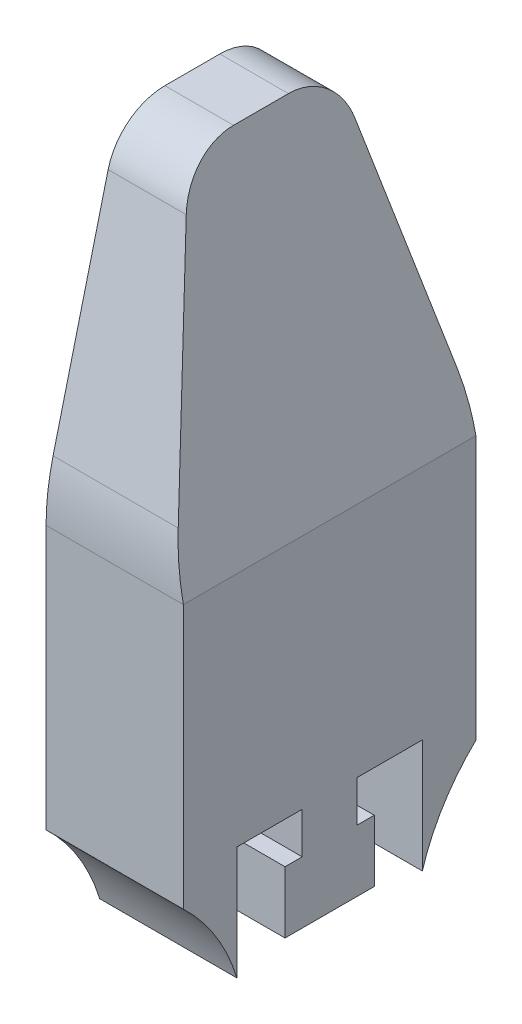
ISO-10303-21;
HEADER;
FILE_DESCRIPTION(('STEP AP214'),'2;1');
FILE_NAME('part.step','',(''),(''),'','','');
FILE_SCHEMA(('AUTOMOTIVE_DESIGN { 1 0 10303 214 1 1 1 1 }'));
ENDSEC;
DATA;
#1=APPLICATION_CONTEXT('core data for automotive mechanical design processes');
#2=APPLICATION_PROTOCOL_DEFINITION('international standard','automotive_design',2000,#1);
#3=PRODUCT_CONTEXT('',#1,'mechanical');
#4=PRODUCT('Part','Part','',(#3));
#5=PRODUCT_RELATED_PRODUCT_CATEGORY('part','',(#4));
#6=PRODUCT_DEFINITION_FORMATION('','',#4);
#7=PRODUCT_DEFINITION_CONTEXT('part definition',#1,'design');
#8=PRODUCT_DEFINITION('design','',#6,#7);
#9=PRODUCT_DEFINITION_SHAPE('','',#8);
#10=(LENGTH_UNIT() NAMED_UNIT(*) SI_UNIT(.MILLI.,.METRE.));
#11=(NAMED_UNIT(*) PLANE_ANGLE_UNIT() SI_UNIT($,.RADIAN.));
#12=(NAMED_UNIT(*) SI_UNIT($,.STERADIAN.) SOLID_ANGLE_UNIT());
#13=UNCERTAINTY_MEASURE_WITH_UNIT(LENGTH_MEASURE(1.E-05),#10,'distance_accuracy_value','');
#14=(GEOMETRIC_REPRESENTATION_CONTEXT(3) GLOBAL_UNCERTAINTY_ASSIGNED_CONTEXT((#13)) GLOBAL_UNIT_ASSIGNED_CONTEXT((#10,
#11,#12)) REPRESENTATION_CONTEXT('',''));
#15=CARTESIAN_POINT('',(0.,0.,0.));
#16=DIRECTION('',(0.,0.,1.));
#17=DIRECTION('',(1.,0.,0.));
#18=AXIS2_PLACEMENT_3D('',#15,#16,#17);
#19=CARTESIAN_POINT('',(20.,-55.2887120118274,41.410883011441));
#20=DIRECTION('',(-1.,0.,0.));
#21=DIRECTION('',(0.,0.,1.));
#22=AXIS2_PLACEMENT_3D('',#19,#20,#21);
#23=CYLINDRICAL_SURFACE('',#22,29.2058551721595);
#24=CARTESIAN_POINT('',(0.,-55.2887120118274,41.410883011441));
#25=DIRECTION('',(-1.,0.,0.));
#26=DIRECTION('',(0.,0.,1.));
#27=AXIS2_PLACEMENT_3D('',#24,#25,#26);
#28=CIRCLE('',#27,29.2058551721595);
#29=CARTESIAN_POINT('',(0.,-34.0988821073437,21.3118013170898));
#30=VERTEX_POINT('',#29);
#31=CARTESIAN_POINT('',(0.,-46.6884453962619,13.5));
#32=VERTEX_POINT('',#31);
#33=EDGE_CURVE('E208',#30,#32,#28,.T.);
#34=ORIENTED_EDGE('',*,*,#33,.T.);
#35=DIRECTION('',(-1.,0.,0.));
#36=VECTOR('',#35,1.);
#37=CARTESIAN_POINT('',(20.,-46.6884453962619,13.5));
#38=LINE('',#37,#36);
#39=CARTESIAN_POINT('',(20.,-46.6884453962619,13.5));
#40=VERTEX_POINT('',#39);
#41=EDGE_CURVE('E11',#40,#32,#38,.T.);
#42=ORIENTED_EDGE('',*,*,#41,.F.);
#43=CARTESIAN_POINT('',(20.,-55.2887120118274,41.410883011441));
#44=DIRECTION('',(-1.,0.,0.));
#45=DIRECTION('',(0.,0.,1.));
#46=AXIS2_PLACEMENT_3D('',#43,#44,#45);
#47=CIRCLE('',#46,29.2058551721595);
#48=CARTESIAN_POINT('',(20.,-34.0988821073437,21.3118013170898));
#49=VERTEX_POINT('',#48);
#50=EDGE_CURVE('E267',#49,#40,#47,.T.);
#51=ORIENTED_EDGE('',*,*,#50,.F.);
#52=DIRECTION('',(-1.,0.,0.));
#53=VECTOR('',#52,1.);
#54=CARTESIAN_POINT('',(20.,-34.0988821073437,21.3118013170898));
#55=LINE('',#54,#53);
#56=EDGE_CURVE('E55',#49,#30,#55,.T.);
#57=ORIENTED_EDGE('',*,*,#56,.T.);
#58=EDGE_LOOP('',(#34,#42,#51,#57));
#59=FACE_BOUND('',#58,.T.);
#60=ADVANCED_FACE('F39',(#59),#23,.F.);
#61=CARTESIAN_POINT('',(20.,-46.6884453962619,13.5));
#62=DIRECTION('',(0.,0.,1.));
#63=DIRECTION('',(0.,-1.,0.));
#64=AXIS2_PLACEMENT_3D('',#61,#62,#63);
#65=PLANE('',#64);
#66=DIRECTION('',(0.,1.,0.));
#67=VECTOR('',#66,1.);
#68=CARTESIAN_POINT('',(0.,-46.6884453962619,13.5));
#69=LINE('',#68,#67);
#70=CARTESIAN_POINT('',(0.,-30.1483231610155,13.5));
#71=VERTEX_POINT('',#70);
#72=EDGE_CURVE('E210',#32,#71,#69,.T.);
#73=ORIENTED_EDGE('',*,*,#72,.T.);
#74=DIRECTION('',(-1.,0.,0.));
#75=VECTOR('',#74,1.);
#76=CARTESIAN_POINT('',(20.,-30.1483231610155,13.5));
#77=LINE('',#76,#75);
#78=CARTESIAN_POINT('',(20.,-30.1483231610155,13.5));
#79=VERTEX_POINT('',#78);
#80=EDGE_CURVE('E47',#79,#71,#77,.T.);
#81=ORIENTED_EDGE('',*,*,#80,.F.);
#82=DIRECTION('',(0.,1.,0.));
#83=VECTOR('',#82,1.);
#84=CARTESIAN_POINT('',(20.,-46.6884453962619,13.5));
#85=LINE('',#84,#83);
#86=EDGE_CURVE('E137',#40,#79,#85,.T.);
#87=ORIENTED_EDGE('',*,*,#86,.F.);
#88=ORIENTED_EDGE('',*,*,#41,.T.);
#89=EDGE_LOOP('',(#73,#81,#87,#88));
#90=FACE_BOUND('',#89,.T.);
#91=ADVANCED_FACE('F371',(#90),#65,.F.);
#92=CARTESIAN_POINT('',(20.,-30.1483231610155,13.5));
#93=DIRECTION('',(0.,1.,0.));
#94=DIRECTION('',(0.,0.,1.));
#95=AXIS2_PLACEMENT_3D('',#92,#93,#94);
#96=PLANE('',#95);
#97=DIRECTION('',(0.,0.,-1.));
#98=VECTOR('',#97,1.);
#99=CARTESIAN_POINT('',(0.,-30.1483231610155,13.5));
#100=LINE('',#99,#98);
#101=CARTESIAN_POINT('',(0.,-30.1483231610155,4.));
#102=VERTEX_POINT('',#101);
#103=EDGE_CURVE('E213',#71,#102,#100,.T.);
#104=ORIENTED_EDGE('',*,*,#103,.T.);
#105=DIRECTION('',(-1.,0.,0.));
#106=VECTOR('',#105,1.);
#107=CARTESIAN_POINT('',(20.,-30.1483231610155,4.));
#108=LINE('',#107,#106);
#109=CARTESIAN_POINT('',(20.,-30.1483231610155,4.));
#110=VERTEX_POINT('',#109);
#111=EDGE_CURVE('E302',#110,#102,#108,.T.);
#112=ORIENTED_EDGE('',*,*,#111,.F.);
#113=DIRECTION('',(0.,0.,-1.));
#114=VECTOR('',#113,1.);
#115=CARTESIAN_POINT('',(20.,-30.1483231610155,13.5));
#116=LINE('',#115,#114);
#117=EDGE_CURVE('E309',#79,#110,#116,.T.);
#118=ORIENTED_EDGE('',*,*,#117,.F.);
#119=ORIENTED_EDGE('',*,*,#80,.T.);
#120=EDGE_LOOP('',(#104,#112,#118,#119));
#121=FACE_BOUND('',#120,.T.);
#122=ADVANCED_FACE('F307',(#121),#96,.F.);
#123=CARTESIAN_POINT('',(20.,-36.1483231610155,4.));
#124=DIRECTION('',(0.,0.,1.));
#125=DIRECTION('',(0.,-1.,0.));
#126=AXIS2_PLACEMENT_3D('',#123,#124,#125);
#127=PLANE('',#126);
#128=DIRECTION('',(0.,1.,0.));
#129=VECTOR('',#128,1.);
#130=CARTESIAN_POINT('',(0.,-36.1483231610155,4.));
#131=LINE('',#130,#129);
#132=CARTESIAN_POINT('',(0.,-36.1483231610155,4.));
#133=VERTEX_POINT('',#132);
#134=EDGE_CURVE('E216',#133,#102,#131,.T.);
#135=ORIENTED_EDGE('',*,*,#134,.F.);
#136=DIRECTION('',(-1.,0.,0.));
#137=VECTOR('',#136,1.);
#138=CARTESIAN_POINT('',(20.,-36.1483231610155,4.));
#139=LINE('',#138,#137);
#140=CARTESIAN_POINT('',(20.,-36.1483231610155,4.));
#141=VERTEX_POINT('',#140);
#142=EDGE_CURVE('E300',#141,#133,#139,.T.);
#143=ORIENTED_EDGE('',*,*,#142,.F.);
#144=DIRECTION('',(0.,1.,0.));
#145=VECTOR('',#144,1.);
#146=CARTESIAN_POINT('',(20.,-36.1483231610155,4.));
#147=LINE('',#146,#145);
#148=EDGE_CURVE('E318',#141,#110,#147,.T.);
#149=ORIENTED_EDGE('',*,*,#148,.T.);
#150=ORIENTED_EDGE('',*,*,#111,.T.);
#151=EDGE_LOOP('',(#135,#143,#149,#150));
#152=FACE_BOUND('',#151,.T.);
#153=ADVANCED_FACE('F315',(#152),#127,.T.);
#154=CARTESIAN_POINT('',(20.,-36.1483231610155,6.5));
#155=DIRECTION('',(0.,1.,0.));
#156=DIRECTION('',(0.,0.,1.));
#157=AXIS2_PLACEMENT_3D('',#154,#155,#156);
#158=PLANE('',#157);
#159=DIRECTION('',(0.,0.,-1.));
#160=VECTOR('',#159,1.);
#161=CARTESIAN_POINT('',(0.,-36.1483231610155,6.5));
#162=LINE('',#161,#160);
#163=CARTESIAN_POINT('',(0.,-36.1483231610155,6.5));
#164=VERTEX_POINT('',#163);
#165=EDGE_CURVE('E219',#164,#133,#162,.T.);
#166=ORIENTED_EDGE('',*,*,#165,.F.);
#167=DIRECTION('',(-1.,0.,0.));
#168=VECTOR('',#167,1.);
#169=CARTESIAN_POINT('',(20.,-36.1483231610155,6.5));
#170=LINE('',#169,#168);
#171=CARTESIAN_POINT('',(20.,-36.1483231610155,6.5));
#172=VERTEX_POINT('',#171);
#173=EDGE_CURVE('E298',#172,#164,#170,.T.);
#174=ORIENTED_EDGE('',*,*,#173,.F.);
#175=DIRECTION('',(0.,0.,-1.));
#176=VECTOR('',#175,1.);
#177=CARTESIAN_POINT('',(20.,-36.1483231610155,6.5));
#178=LINE('',#177,#176);
#179=EDGE_CURVE('E321',#172,#141,#178,.T.);
#180=ORIENTED_EDGE('',*,*,#179,.T.);
#181=ORIENTED_EDGE('',*,*,#142,.T.);
#182=EDGE_LOOP('',(#166,#174,#180,#181));
#183=FACE_BOUND('',#182,.T.);
#184=ADVANCED_FACE('F381',(#183),#158,.T.);
#185=CARTESIAN_POINT('',(20.,-45.1483231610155,6.5));
#186=DIRECTION('',(0.,0.,1.));
#187=DIRECTION('',(1.,0.,0.));
#188=AXIS2_PLACEMENT_3D('',#185,#186,#187);
#189=PLANE('',#188);
#190=DIRECTION('',(0.,1.,0.));
#191=VECTOR('',#190,1.);
#192=CARTESIAN_POINT('',(0.,-45.1483231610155,6.5));
#193=LINE('',#192,#191);
#194=CARTESIAN_POINT('',(0.,-45.1483231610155,6.5));
#195=VERTEX_POINT('',#194);
#196=EDGE_CURVE('E222',#195,#164,#193,.T.);
#197=ORIENTED_EDGE('',*,*,#196,.F.);
#198=DIRECTION('',(-1.,0.,0.));
#199=VECTOR('',#198,1.);
#200=CARTESIAN_POINT('',(20.,-45.1483231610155,6.5));
#201=LINE('',#200,#199);
#202=CARTESIAN_POINT('',(20.,-45.1483231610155,6.5));
#203=VERTEX_POINT('',#202);
#204=EDGE_CURVE('E296',#203,#195,#201,.T.);
#205=ORIENTED_EDGE('',*,*,#204,.F.);
#206=DIRECTION('',(0.,1.,0.));
#207=VECTOR('',#206,1.);
#208=CARTESIAN_POINT('',(20.,-45.1483231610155,6.5));
#209=LINE('',#208,#207);
#210=EDGE_CURVE('E323',#203,#172,#209,.T.);
#211=ORIENTED_EDGE('',*,*,#210,.T.);
#212=ORIENTED_EDGE('',*,*,#173,.T.);
#213=EDGE_LOOP('',(#197,#205,#211,#212));
#214=FACE_BOUND('',#213,.T.);
#215=ADVANCED_FACE('F384',(#214),#189,.T.);
#216=CARTESIAN_POINT('',(20.,-45.1483231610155,6.5));
#217=DIRECTION('',(0.,1.,0.));
#218=DIRECTION('',(0.,0.,1.));
#219=AXIS2_PLACEMENT_3D('',#216,#217,#218);
#220=PLANE('',#219);
#221=DIRECTION('',(0.,0.,-1.));
#222=VECTOR('',#221,1.);
#223=CARTESIAN_POINT('',(0.,-45.1483231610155,6.5));
#224=LINE('',#223,#222);
#225=CARTESIAN_POINT('',(0.,-45.1483231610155,-6.5));
#226=VERTEX_POINT('',#225);
#227=EDGE_CURVE('E225',#195,#226,#224,.T.);
#228=ORIENTED_EDGE('',*,*,#227,.T.);
#229=DIRECTION('',(-1.,0.,0.));
#230=VECTOR('',#229,1.);
#231=CARTESIAN_POINT('',(20.,-45.1483231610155,-6.5));
#232=LINE('',#231,#230);
#233=CARTESIAN_POINT('',(20.,-45.1483231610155,-6.5));
#234=VERTEX_POINT('',#233);
#235=EDGE_CURVE('E293',#234,#226,#232,.T.);
#236=ORIENTED_EDGE('',*,*,#235,.F.);
#237=DIRECTION('',(0.,0.,-1.));
#238=VECTOR('',#237,1.);
#239=CARTESIAN_POINT('',(20.,-45.1483231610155,6.5));
#240=LINE('',#239,#238);
#241=EDGE_CURVE('E330',#203,#234,#240,.T.);
#242=ORIENTED_EDGE('',*,*,#241,.F.);
#243=ORIENTED_EDGE('',*,*,#204,.T.);
#244=EDGE_LOOP('',(#228,#236,#242,#243));
#245=FACE_BOUND('',#244,.T.);
#246=ADVANCED_FACE('F388',(#245),#220,.F.);
#247=CARTESIAN_POINT('',(20.,-45.1483231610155,-6.5));
#248=DIRECTION('',(0.,0.,1.));
#249=DIRECTION('',(0.,-1.,0.));
#250=AXIS2_PLACEMENT_3D('',#247,#248,#249);
#251=PLANE('',#250);
#252=DIRECTION('',(0.,1.,0.));
#253=VECTOR('',#252,1.);
#254=CARTESIAN_POINT('',(0.,-45.1483231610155,-6.5));
#255=LINE('',#254,#253);
#256=CARTESIAN_POINT('',(0.,-36.1483231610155,-6.5));
#257=VERTEX_POINT('',#256);
#258=EDGE_CURVE('E227',#226,#257,#255,.T.);
#259=ORIENTED_EDGE('',*,*,#258,.T.);
#260=DIRECTION('',(-1.,0.,0.));
#261=VECTOR('',#260,1.);
#262=CARTESIAN_POINT('',(20.,-36.1483231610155,-6.5));
#263=LINE('',#262,#261);
#264=CARTESIAN_POINT('',(20.,-36.1483231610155,-6.5));
#265=VERTEX_POINT('',#264);
#266=EDGE_CURVE('E291',#265,#257,#263,.T.);
#267=ORIENTED_EDGE('',*,*,#266,.F.);
#268=DIRECTION('',(0.,1.,0.));
#269=VECTOR('',#268,1.);
#270=CARTESIAN_POINT('',(20.,-45.1483231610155,-6.5));
#271=LINE('',#270,#269);
#272=EDGE_CURVE('E332',#234,#265,#271,.T.);
#273=ORIENTED_EDGE('',*,*,#272,.F.);
#274=ORIENTED_EDGE('',*,*,#235,.T.);
#275=EDGE_LOOP('',(#259,#267,#273,#274));
#276=FACE_BOUND('',#275,.T.);
#277=ADVANCED_FACE('F392',(#276),#251,.F.);
#278=CARTESIAN_POINT('',(20.,-36.1483231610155,-4.));
#279=DIRECTION('',(0.,1.,0.));
#280=DIRECTION('',(0.,0.,1.));
#281=AXIS2_PLACEMENT_3D('',#278,#279,#280);
#282=PLANE('',#281);
#283=DIRECTION('',(0.,0.,-1.));
#284=VECTOR('',#283,1.);
#285=CARTESIAN_POINT('',(0.,-36.1483231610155,-4.));
#286=LINE('',#285,#284);
#287=CARTESIAN_POINT('',(0.,-36.1483231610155,-4.));
#288=VERTEX_POINT('',#287);
#289=EDGE_CURVE('E230',#288,#257,#286,.T.);
#290=ORIENTED_EDGE('',*,*,#289,.F.);
#291=DIRECTION('',(-1.,0.,0.));
#292=VECTOR('',#291,1.);
#293=CARTESIAN_POINT('',(20.,-36.1483231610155,-4.));
#294=LINE('',#293,#292);
#295=CARTESIAN_POINT('',(20.,-36.1483231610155,-4.));
#296=VERTEX_POINT('',#295);
#297=EDGE_CURVE('E289',#296,#288,#294,.T.);
#298=ORIENTED_EDGE('',*,*,#297,.F.);
#299=DIRECTION('',(0.,0.,-1.));
#300=VECTOR('',#299,1.);
#301=CARTESIAN_POINT('',(20.,-36.1483231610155,-4.));
#302=LINE('',#301,#300);
#303=EDGE_CURVE('E334',#296,#265,#302,.T.);
#304=ORIENTED_EDGE('',*,*,#303,.T.);
#305=ORIENTED_EDGE('',*,*,#266,.T.);
#306=EDGE_LOOP('',(#290,#298,#304,#305));
#307=FACE_BOUND('',#306,.T.);
#308=ADVANCED_FACE('F396',(#307),#282,.T.);
#309=CARTESIAN_POINT('',(20.,-36.1483231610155,-4.));
#310=DIRECTION('',(0.,0.,1.));
#311=DIRECTION('',(1.,0.,0.));
#312=AXIS2_PLACEMENT_3D('',#309,#310,#311);
#313=PLANE('',#312);
#314=DIRECTION('',(0.,1.,0.));
#315=VECTOR('',#314,1.);
#316=CARTESIAN_POINT('',(0.,-36.1483231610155,-4.));
#317=LINE('',#316,#315);
#318=CARTESIAN_POINT('',(0.,-30.1483231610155,-4.));
#319=VERTEX_POINT('',#318);
#320=EDGE_CURVE('E233',#288,#319,#317,.T.);
#321=ORIENTED_EDGE('',*,*,#320,.T.);
#322=DIRECTION('',(-1.,0.,0.));
#323=VECTOR('',#322,1.);
#324=CARTESIAN_POINT('',(20.,-30.1483231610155,-4.));
#325=LINE('',#324,#323);
#326=CARTESIAN_POINT('',(20.,-30.1483231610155,-4.));
#327=VERTEX_POINT('',#326);
#328=EDGE_CURVE('E286',#327,#319,#325,.T.);
#329=ORIENTED_EDGE('',*,*,#328,.F.);
#330=DIRECTION('',(0.,1.,0.));
#331=VECTOR('',#330,1.);
#332=CARTESIAN_POINT('',(20.,-36.1483231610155,-4.));
#333=LINE('',#332,#331);
#334=EDGE_CURVE('E337',#296,#327,#333,.T.);
#335=ORIENTED_EDGE('',*,*,#334,.F.);
#336=ORIENTED_EDGE('',*,*,#297,.T.);
#337=EDGE_LOOP('',(#321,#329,#335,#336));
#338=FACE_BOUND('',#337,.T.);
#339=ADVANCED_FACE('F400',(#338),#313,.F.);
#340=CARTESIAN_POINT('',(20.,-30.1483231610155,-4.));
#341=DIRECTION('',(0.,1.,0.));
#342=DIRECTION('',(0.,0.,1.));
#343=AXIS2_PLACEMENT_3D('',#340,#341,#342);
#344=PLANE('',#343);
#345=DIRECTION('',(0.,0.,-1.));
#346=VECTOR('',#345,1.);
#347=CARTESIAN_POINT('',(0.,-30.1483231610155,-4.));
#348=LINE('',#347,#346);
#349=CARTESIAN_POINT('',(0.,-30.1483231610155,-13.5));
#350=VERTEX_POINT('',#349);
#351=EDGE_CURVE('E235',#319,#350,#348,.T.);
#352=ORIENTED_EDGE('',*,*,#351,.T.);
#353=DIRECTION('',(-1.,0.,0.));
#354=VECTOR('',#353,1.);
#355=CARTESIAN_POINT('',(20.,-30.1483231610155,-13.5));
#356=LINE('',#355,#354);
#357=CARTESIAN_POINT('',(20.,-30.1483231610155,-13.5));
#358=VERTEX_POINT('',#357);
#359=EDGE_CURVE('E284',#358,#350,#356,.T.);
#360=ORIENTED_EDGE('',*,*,#359,.F.);
#361=DIRECTION('',(0.,0.,-1.));
#362=VECTOR('',#361,1.);
#363=CARTESIAN_POINT('',(20.,-30.1483231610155,-4.));
#364=LINE('',#363,#362);
#365=EDGE_CURVE('E203',#327,#358,#364,.T.);
#366=ORIENTED_EDGE('',*,*,#365,.F.);
#367=ORIENTED_EDGE('',*,*,#328,.T.);
#368=EDGE_LOOP('',(#352,#360,#366,#367));
#369=FACE_BOUND('',#368,.T.);
#370=ADVANCED_FACE('F344',(#369),#344,.F.);
#371=CARTESIAN_POINT('',(20.,-46.6884453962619,-13.5));
#372=DIRECTION('',(0.,0.,1.));
#373=DIRECTION('',(0.,-1.,0.));
#374=AXIS2_PLACEMENT_3D('',#371,#372,#373);
#375=PLANE('',#374);
#376=DIRECTION('',(0.,1.,0.));
#377=VECTOR('',#376,1.);
#378=CARTESIAN_POINT('',(0.,-46.6884453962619,-13.5));
#379=LINE('',#378,#377);
#380=CARTESIAN_POINT('',(0.,-46.6884453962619,-13.5));
#381=VERTEX_POINT('',#380);
#382=EDGE_CURVE('E238',#381,#350,#379,.T.);
#383=ORIENTED_EDGE('',*,*,#382,.F.);
#384=DIRECTION('',(-1.,0.,0.));
#385=VECTOR('',#384,1.);
#386=CARTESIAN_POINT('',(20.,-46.6884453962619,-13.5));
#387=LINE('',#386,#385);
#388=CARTESIAN_POINT('',(20.,-46.6884453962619,-13.5));
#389=VERTEX_POINT('',#388);
#390=EDGE_CURVE('E186',#389,#381,#387,.T.);
#391=ORIENTED_EDGE('',*,*,#390,.F.);
#392=DIRECTION('',(0.,1.,0.));
#393=VECTOR('',#392,1.);
#394=CARTESIAN_POINT('',(20.,-46.6884453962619,-13.5));
#395=LINE('',#394,#393);
#396=EDGE_CURVE('E201',#389,#358,#395,.T.);
#397=ORIENTED_EDGE('',*,*,#396,.T.);
#398=ORIENTED_EDGE('',*,*,#359,.T.);
#399=EDGE_LOOP('',(#383,#391,#397,#398));
#400=FACE_BOUND('',#399,.T.);
#401=ADVANCED_FACE('F348',(#400),#375,.T.);
#402=CARTESIAN_POINT('',(20.,-55.2887120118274,-41.410883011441));
#403=DIRECTION('',(-1.,0.,0.));
#404=DIRECTION('',(0.,0.,1.));
#405=AXIS2_PLACEMENT_3D('',#402,#403,#404);
#406=CYLINDRICAL_SURFACE('',#405,29.2058551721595);
#407=CARTESIAN_POINT('',(0.,-55.2887120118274,-41.410883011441));
#408=DIRECTION('',(1.,0.,0.));
#409=DIRECTION('',(0.,0.,-1.));
#410=AXIS2_PLACEMENT_3D('',#407,#408,#409);
#411=CIRCLE('',#410,29.2058551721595);
#412=CARTESIAN_POINT('',(0.,-34.0988821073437,-21.3118013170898));
#413=VERTEX_POINT('',#412);
#414=EDGE_CURVE('E182',#413,#381,#411,.T.);
#415=ORIENTED_EDGE('',*,*,#414,.F.);
#416=DIRECTION('',(-1.,0.,0.));
#417=VECTOR('',#416,1.);
#418=CARTESIAN_POINT('',(20.,-34.0988821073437,-21.3118013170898));
#419=LINE('',#418,#417);
#420=CARTESIAN_POINT('',(20.,-34.0988821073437,-21.3118013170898));
#421=VERTEX_POINT('',#420);
#422=EDGE_CURVE('E176',#421,#413,#419,.T.);
#423=ORIENTED_EDGE('',*,*,#422,.F.);
#424=CARTESIAN_POINT('',(20.,-55.2887120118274,-41.410883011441));
#425=DIRECTION('',(1.,0.,0.));
#426=DIRECTION('',(0.,0.,-1.));
#427=AXIS2_PLACEMENT_3D('',#424,#425,#426);
#428=CIRCLE('',#427,29.2058551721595);
#429=EDGE_CURVE('E180',#421,#389,#428,.T.);
#430=ORIENTED_EDGE('',*,*,#429,.T.);
#431=ORIENTED_EDGE('',*,*,#390,.T.);
#432=EDGE_LOOP('',(#415,#423,#430,#431));
#433=FACE_BOUND('',#432,.T.);
#434=ADVANCED_FACE('F178',(#433),#406,.F.);
#435=CARTESIAN_POINT('',(20.,-34.0988821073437,-21.3118013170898));
#436=DIRECTION('',(0.,0.,1.));
#437=DIRECTION('',(1.,0.,0.));
#438=AXIS2_PLACEMENT_3D('',#435,#436,#437);
#439=PLANE('',#438);
#440=DIRECTION('',(0.,1.,0.));
#441=VECTOR('',#440,1.);
#442=CARTESIAN_POINT('',(0.,-34.0988821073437,-21.3118013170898));
#443=LINE('',#442,#441);
#444=CARTESIAN_POINT('',(0.,4.32695631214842,-21.3118013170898));
#445=VERTEX_POINT('',#444);
#446=EDGE_CURVE('E242',#413,#445,#443,.T.);
#447=ORIENTED_EDGE('',*,*,#446,.T.);
#448=DIRECTION('',(-1.,0.,0.));
#449=VECTOR('',#448,1.);
#450=CARTESIAN_POINT('',(20.,4.32695631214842,-21.3118013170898));
#451=LINE('',#450,#449);
#452=CARTESIAN_POINT('',(20.,4.3269563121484,-21.3118013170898));
#453=VERTEX_POINT('',#452);
#454=EDGE_CURVE('E187',#453,#445,#451,.T.);
#455=ORIENTED_EDGE('',*,*,#454,.F.);
#456=DIRECTION('',(0.,1.,0.));
#457=VECTOR('',#456,1.);
#458=CARTESIAN_POINT('',(20.,-34.0988821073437,-21.3118013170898));
#459=LINE('',#458,#457);
#460=EDGE_CURVE('E191',#421,#453,#459,.T.);
#461=ORIENTED_EDGE('',*,*,#460,.F.);
#462=ORIENTED_EDGE('',*,*,#422,.T.);
#463=EDGE_LOOP('',(#447,#455,#461,#462));
#464=FACE_BOUND('',#463,.T.);
#465=ADVANCED_FACE('F192',(#464),#439,.F.);
#466=CARTESIAN_POINT('',(20.,4.32695631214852,12.7870807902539));
#467=DIRECTION('',(-1.,0.,0.));
#468=DIRECTION('',(0.,0.,1.));
#469=AXIS2_PLACEMENT_3D('',#466,#467,#468);
#470=CYLINDRICAL_SURFACE('',#469,34.0988821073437);
#471=CARTESIAN_POINT('',(20.,4.32695631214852,12.7870807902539));
#472=DIRECTION('',(-0.977944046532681,-0.208867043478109,0.));
#473=DIRECTION('',(-0.208867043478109,0.977944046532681,0.));
#474=AXIS2_PLACEMENT_3D('',#471,#472,#473);
#475=ELLIPSE('',#474,34.8679274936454,34.0988821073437);
#476=CARTESIAN_POINT('',(18.2336710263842,12.5971499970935,-20.2936939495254));
#477=VERTEX_POINT('',#476);
#478=EDGE_CURVE('E211',#453,#477,#475,.F.);
#479=ORIENTED_EDGE('',*,*,#478,.F.);
#480=ORIENTED_EDGE('',*,*,#454,.T.);
#481=CARTESIAN_POINT('',(0.,4.32695631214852,12.7870807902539));
#482=DIRECTION('',(-1.,0.,0.));
#483=DIRECTION('',(0.,0.,1.));
#484=AXIS2_PLACEMENT_3D('',#481,#482,#483);
#485=CIRCLE('',#484,34.0988821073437);
#486=CARTESIAN_POINT('',(0.,12.5971499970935,-20.2936939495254));
#487=VERTEX_POINT('',#486);
#488=EDGE_CURVE('E244',#487,#445,#485,.T.);
#489=ORIENTED_EDGE('',*,*,#488,.F.);
#490=DIRECTION('',(-1.,0.,0.));
#491=VECTOR('',#490,1.);
#492=CARTESIAN_POINT('',(20.,12.5971499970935,-20.2936939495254));
#493=LINE('',#492,#491);
#494=EDGE_CURVE('E280',#477,#487,#493,.T.);
#495=ORIENTED_EDGE('',*,*,#494,.F.);
#496=EDGE_LOOP('',(#479,#480,#489,#495));
#497=FACE_BOUND('',#496,.T.);
#498=ADVANCED_FACE('F355',(#497),#470,.T.);
#499=CARTESIAN_POINT('',(20.,12.5971499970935,-20.2936939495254));
#500=DIRECTION('',(0.,-0.242535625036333,0.970142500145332));
#501=DIRECTION('',(0.,-0.970142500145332,-0.242535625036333));
#502=AXIS2_PLACEMENT_3D('',#499,#500,#501);
#503=PLANE('',#502);
#504=DIRECTION('',(-1.,0.,0.));
#505=VECTOR('',#504,1.);
#506=CARTESIAN_POINT('',(20.,44.6911510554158,-12.2701936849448));
#507=LINE('',#506,#505);
#508=CARTESIAN_POINT('',(11.3791079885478,44.6911510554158,-12.2701936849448));
#509=VERTEX_POINT('',#508);
#510=CARTESIAN_POINT('',(0.,44.6911510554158,-12.2701936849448));
#511=VERTEX_POINT('',#510);
#512=EDGE_CURVE('E278',#509,#511,#507,.T.);
#513=ORIENTED_EDGE('',*,*,#512,.F.);
#514=DIRECTION('',(0.202891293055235,-0.949964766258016,-0.237491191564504));
#515=VECTOR('',#514,1.);
#516=CARTESIAN_POINT('',(18.3063817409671,12.2567084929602,-20.3788043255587));
#517=LINE('',#516,#515);
#518=EDGE_CURVE('E363',#509,#477,#517,.T.);
#519=ORIENTED_EDGE('',*,*,#518,.T.);
#520=ORIENTED_EDGE('',*,*,#494,.T.);
#521=DIRECTION('',(0.,0.970142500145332,0.242535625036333));
#522=VECTOR('',#521,1.);
#523=CARTESIAN_POINT('',(0.,12.5971499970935,-20.2936939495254));
#524=LINE('',#523,#522);
#525=EDGE_CURVE('E247',#487,#511,#524,.T.);
#526=ORIENTED_EDGE('',*,*,#525,.T.);
#527=EDGE_LOOP('',(#513,#519,#520,#526));
#528=FACE_BOUND('',#527,.T.);
#529=ADVANCED_FACE('F415',(#528),#503,.F.);
#530=CARTESIAN_POINT('',(20.,42.6236026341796,-4.));
#531=DIRECTION('',(-1.,0.,0.));
#532=DIRECTION('',(0.,0.,1.));
#533=AXIS2_PLACEMENT_3D('',#530,#531,#532);
#534=CYLINDRICAL_SURFACE('',#533,8.52472052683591);
#535=DIRECTION('',(-1.,0.,0.));
#536=VECTOR('',#535,1.);
#537=CARTESIAN_POINT('',(20.,51.1483231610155,-3.99999999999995));
#538=LINE('',#537,#536);
#539=CARTESIAN_POINT('',(10.,51.1483231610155,-3.99999999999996));
#540=VERTEX_POINT('',#539);
#541=CARTESIAN_POINT('',(0.,51.1483231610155,-3.99999999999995));
#542=VERTEX_POINT('',#541);
#543=EDGE_CURVE('E276',#540,#542,#538,.T.);
#544=ORIENTED_EDGE('',*,*,#543,.F.);
#545=CARTESIAN_POINT('',(11.8206902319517,42.6236026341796,-4.));
#546=DIRECTION('',(-0.977944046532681,-0.208867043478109,0.));
#547=DIRECTION('',(-0.208867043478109,0.977944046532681,0.));
#548=AXIS2_PLACEMENT_3D('',#545,#546,#547);
#549=ELLIPSE('',#548,8.71698187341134,8.52472052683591);
#550=EDGE_CURVE('E365',#540,#509,#549,.T.);
#551=ORIENTED_EDGE('',*,*,#550,.T.);
#552=ORIENTED_EDGE('',*,*,#512,.T.);
#553=CARTESIAN_POINT('',(0.,42.6236026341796,-4.));
#554=DIRECTION('',(1.,0.,0.));
#555=DIRECTION('',(0.,0.,-1.));
#556=AXIS2_PLACEMENT_3D('',#553,#554,#555);
#557=CIRCLE('',#556,8.52472052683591);
#558=EDGE_CURVE('E250',#511,#542,#557,.T.);
#559=ORIENTED_EDGE('',*,*,#558,.T.);
#560=EDGE_LOOP('',(#544,#551,#552,#559));
#561=FACE_BOUND('',#560,.T.);
#562=ADVANCED_FACE('F418',(#561),#534,.T.);
#563=CARTESIAN_POINT('',(20.,51.1483231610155,3.99999999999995));
#564=DIRECTION('',(0.,1.,0.));
#565=DIRECTION('',(0.,0.,1.));
#566=AXIS2_PLACEMENT_3D('',#563,#564,#565);
#567=PLANE('',#566);
#568=DIRECTION('',(0.,0.,1.));
#569=VECTOR('',#568,1.);
#570=CARTESIAN_POINT('',(10.,51.1483231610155,-21.3118013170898));
#571=LINE('',#570,#569);
#572=CARTESIAN_POINT('',(10.,51.1483231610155,4.));
#573=VERTEX_POINT('',#572);
#574=EDGE_CURVE('E613',#540,#573,#571,.T.);
#575=ORIENTED_EDGE('',*,*,#574,.F.);
#576=ORIENTED_EDGE('',*,*,#543,.T.);
#577=DIRECTION('',(0.,0.,-1.));
#578=VECTOR('',#577,1.);
#579=CARTESIAN_POINT('',(0.,51.1483231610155,3.99999999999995));
#580=LINE('',#579,#578);
#581=CARTESIAN_POINT('',(0.,51.1483231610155,3.99999999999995));
#582=VERTEX_POINT('',#581);
#583=EDGE_CURVE('E253',#582,#542,#580,.T.);
#584=ORIENTED_EDGE('',*,*,#583,.F.);
#585=DIRECTION('',(-1.,0.,0.));
#586=VECTOR('',#585,1.);
#587=CARTESIAN_POINT('',(20.,51.1483231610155,3.99999999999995));
#588=LINE('',#587,#586);
#589=EDGE_CURVE('E274',#573,#582,#588,.T.);
#590=ORIENTED_EDGE('',*,*,#589,.F.);
#591=EDGE_LOOP('',(#575,#576,#584,#590));
#592=FACE_BOUND('',#591,.T.);
#593=ADVANCED_FACE('F422',(#592),#567,.T.);
#594=CARTESIAN_POINT('',(20.,42.6236026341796,4.));
#595=DIRECTION('',(-1.,0.,0.));
#596=DIRECTION('',(0.,0.,1.));
#597=AXIS2_PLACEMENT_3D('',#594,#595,#596);
#598=CYLINDRICAL_SURFACE('',#597,8.52472052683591);
#599=CARTESIAN_POINT('',(11.8206902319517,42.6236026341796,4.));
#600=DIRECTION('',(-0.977944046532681,-0.208867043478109,0.));
#601=DIRECTION('',(-0.208867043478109,0.977944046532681,0.));
#602=AXIS2_PLACEMENT_3D('',#599,#600,#601);
#603=ELLIPSE('',#602,8.71698187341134,8.52472052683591);
#604=CARTESIAN_POINT('',(11.3791079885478,44.6911510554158,12.2701936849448));
#605=VERTEX_POINT('',#604);
#606=EDGE_CURVE('E623',#573,#605,#603,.F.);
#607=ORIENTED_EDGE('',*,*,#606,.F.);
#608=ORIENTED_EDGE('',*,*,#589,.T.);
#609=CARTESIAN_POINT('',(0.,42.6236026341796,4.));
#610=DIRECTION('',(-1.,0.,0.));
#611=DIRECTION('',(0.,0.,1.));
#612=AXIS2_PLACEMENT_3D('',#609,#610,#611);
#613=CIRCLE('',#612,8.52472052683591);
#614=CARTESIAN_POINT('',(0.,44.6911510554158,12.2701936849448));
#615=VERTEX_POINT('',#614);
#616=EDGE_CURVE('E256',#615,#582,#613,.T.);
#617=ORIENTED_EDGE('',*,*,#616,.F.);
#618=DIRECTION('',(-1.,0.,0.));
#619=VECTOR('',#618,1.);
#620=CARTESIAN_POINT('',(20.,44.6911510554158,12.2701936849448));
#621=LINE('',#620,#619);
#622=EDGE_CURVE('E272',#605,#615,#621,.T.);
#623=ORIENTED_EDGE('',*,*,#622,.F.);
#624=EDGE_LOOP('',(#607,#608,#617,#623));
#625=FACE_BOUND('',#624,.T.);
#626=ADVANCED_FACE('F426',(#625),#598,.T.);
#627=CARTESIAN_POINT('',(20.,12.5971499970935,20.2936939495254));
#628=DIRECTION('',(0.,0.242535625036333,0.970142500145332));
#629=DIRECTION('',(0.,-0.970142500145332,0.242535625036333));
#630=AXIS2_PLACEMENT_3D('',#627,#628,#629);
#631=PLANE('',#630);
#632=DIRECTION('',(0.202891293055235,-0.949964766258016,0.237491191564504));
#633=VECTOR('',#632,1.);
#634=CARTESIAN_POINT('',(18.3063817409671,12.2567084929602,20.3788043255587));
#635=LINE('',#634,#633);
#636=CARTESIAN_POINT('',(18.2336710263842,12.5971499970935,20.2936939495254));
#637=VERTEX_POINT('',#636);
#638=EDGE_CURVE('E605',#605,#637,#635,.T.);
#639=ORIENTED_EDGE('',*,*,#638,.F.);
#640=ORIENTED_EDGE('',*,*,#622,.T.);
#641=DIRECTION('',(0.,0.970142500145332,-0.242535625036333));
#642=VECTOR('',#641,1.);
#643=CARTESIAN_POINT('',(0.,12.5971499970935,20.2936939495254));
#644=LINE('',#643,#642);
#645=CARTESIAN_POINT('',(0.,12.5971499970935,20.2936939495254));
#646=VERTEX_POINT('',#645);
#647=EDGE_CURVE('E259',#646,#615,#644,.T.);
#648=ORIENTED_EDGE('',*,*,#647,.F.);
#649=DIRECTION('',(-1.,0.,0.));
#650=VECTOR('',#649,1.);
#651=CARTESIAN_POINT('',(20.,12.5971499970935,20.2936939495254));
#652=LINE('',#651,#650);
#653=EDGE_CURVE('E270',#637,#646,#652,.T.);
#654=ORIENTED_EDGE('',*,*,#653,.F.);
#655=EDGE_LOOP('',(#639,#640,#648,#654));
#656=FACE_BOUND('',#655,.T.);
#657=ADVANCED_FACE('F430',(#656),#631,.T.);
#658=CARTESIAN_POINT('',(20.,4.32695631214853,-12.7870807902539));
#659=DIRECTION('',(-1.,0.,0.));
#660=DIRECTION('',(0.,0.,1.));
#661=AXIS2_PLACEMENT_3D('',#658,#659,#660);
#662=CYLINDRICAL_SURFACE('',#661,34.0988821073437);
#663=DIRECTION('',(-1.,0.,0.));
#664=VECTOR('',#663,1.);
#665=CARTESIAN_POINT('',(20.,4.3269563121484,21.3118013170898));
#666=LINE('',#665,#664);
#667=CARTESIAN_POINT('',(20.,4.3269563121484,21.3118013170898));
#668=VERTEX_POINT('',#667);
#669=CARTESIAN_POINT('',(0.,4.3269563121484,21.3118013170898));
#670=VERTEX_POINT('',#669);
#671=EDGE_CURVE('E125',#668,#670,#666,.T.);
#672=ORIENTED_EDGE('',*,*,#671,.F.);
#673=CARTESIAN_POINT('',(20.,4.32695631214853,-12.7870807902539));
#674=DIRECTION('',(-0.977944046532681,-0.208867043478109,0.));
#675=DIRECTION('',(-0.208867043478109,0.977944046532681,0.));
#676=AXIS2_PLACEMENT_3D('',#673,#674,#675);
#677=ELLIPSE('',#676,34.8679274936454,34.0988821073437);
#678=EDGE_CURVE('E627',#668,#637,#677,.T.);
#679=ORIENTED_EDGE('',*,*,#678,.T.);
#680=ORIENTED_EDGE('',*,*,#653,.T.);
#681=CARTESIAN_POINT('',(0.,4.32695631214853,-12.7870807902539));
#682=DIRECTION('',(1.,0.,0.));
#683=DIRECTION('',(0.,0.,-1.));
#684=AXIS2_PLACEMENT_3D('',#681,#682,#683);
#685=CIRCLE('',#684,34.0988821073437);
#686=EDGE_CURVE('E262',#646,#670,#685,.T.);
#687=ORIENTED_EDGE('',*,*,#686,.T.);
#688=EDGE_LOOP('',(#672,#679,#680,#687));
#689=FACE_BOUND('',#688,.T.);
#690=ADVANCED_FACE('F434',(#689),#662,.T.);
#691=CARTESIAN_POINT('',(20.,-34.0988821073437,21.3118013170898));
#692=DIRECTION('',(0.,0.,1.));
#693=DIRECTION('',(1.,0.,0.));
#694=AXIS2_PLACEMENT_3D('',#691,#692,#693);
#695=PLANE('',#694);
#696=DIRECTION('',(0.,1.,0.));
#697=VECTOR('',#696,1.);
#698=CARTESIAN_POINT('',(0.,-34.0988821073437,21.3118013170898));
#699=LINE('',#698,#697);
#700=EDGE_CURVE('E264',#30,#670,#699,.T.);
#701=ORIENTED_EDGE('',*,*,#700,.F.);
#702=ORIENTED_EDGE('',*,*,#56,.F.);
#703=DIRECTION('',(0.,1.,0.));
#704=VECTOR('',#703,1.);
#705=CARTESIAN_POINT('',(20.,-34.0988821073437,21.3118013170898));
#706=LINE('',#705,#704);
#707=EDGE_CURVE('E196',#49,#668,#706,.T.);
#708=ORIENTED_EDGE('',*,*,#707,.T.);
#709=ORIENTED_EDGE('',*,*,#671,.T.);
#710=EDGE_LOOP('',(#701,#702,#708,#709));
#711=FACE_BOUND('',#710,.T.);
#712=ADVANCED_FACE('F438',(#711),#695,.T.);
#713=CARTESIAN_POINT('',(20.,-55.2887120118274,41.410883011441));
#714=DIRECTION('',(-1.,0.,0.));
#715=DIRECTION('',(0.,0.,1.));
#716=AXIS2_PLACEMENT_3D('',#713,#714,#715);
#717=PLANE('',#716);
#718=ORIENTED_EDGE('',*,*,#460,.T.);
#719=DIRECTION('',(0.,0.,1.));
#720=VECTOR('',#719,1.);
#721=CARTESIAN_POINT('',(20.,4.3269563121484,-21.3118013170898));
#722=LINE('',#721,#720);
#723=EDGE_CURVE('E624',#453,#668,#722,.T.);
#724=ORIENTED_EDGE('',*,*,#723,.T.);
#725=ORIENTED_EDGE('',*,*,#707,.F.);
#726=ORIENTED_EDGE('',*,*,#50,.T.);
#727=ORIENTED_EDGE('',*,*,#86,.T.);
#728=ORIENTED_EDGE('',*,*,#117,.T.);
#729=ORIENTED_EDGE('',*,*,#148,.F.);
#730=ORIENTED_EDGE('',*,*,#179,.F.);
#731=ORIENTED_EDGE('',*,*,#210,.F.);
#732=ORIENTED_EDGE('',*,*,#241,.T.);
#733=ORIENTED_EDGE('',*,*,#272,.T.);
#734=ORIENTED_EDGE('',*,*,#303,.F.);
#735=ORIENTED_EDGE('',*,*,#334,.T.);
#736=ORIENTED_EDGE('',*,*,#365,.T.);
#737=ORIENTED_EDGE('',*,*,#396,.F.);
#738=ORIENTED_EDGE('',*,*,#429,.F.);
#739=EDGE_LOOP('',(#718,#724,#725,#726,#727,#728,#729,#730,#731,#732,#733,#734,#735,#736,#737,#738));
#740=FACE_BOUND('',#739,.T.);
#741=ADVANCED_FACE('F199',(#740),#717,.F.);
#742=CARTESIAN_POINT('',(0.,-55.2887120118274,41.410883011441));
#743=DIRECTION('',(-1.,0.,0.));
#744=DIRECTION('',(0.,0.,1.));
#745=AXIS2_PLACEMENT_3D('',#742,#743,#744);
#746=PLANE('',#745);
#747=ORIENTED_EDGE('',*,*,#33,.F.);
#748=ORIENTED_EDGE('',*,*,#700,.T.);
#749=ORIENTED_EDGE('',*,*,#686,.F.);
#750=ORIENTED_EDGE('',*,*,#647,.T.);
#751=ORIENTED_EDGE('',*,*,#616,.T.);
#752=ORIENTED_EDGE('',*,*,#583,.T.);
#753=ORIENTED_EDGE('',*,*,#558,.F.);
#754=ORIENTED_EDGE('',*,*,#525,.F.);
#755=ORIENTED_EDGE('',*,*,#488,.T.);
#756=ORIENTED_EDGE('',*,*,#446,.F.);
#757=ORIENTED_EDGE('',*,*,#414,.T.);
#758=ORIENTED_EDGE('',*,*,#382,.T.);
#759=ORIENTED_EDGE('',*,*,#351,.F.);
#760=ORIENTED_EDGE('',*,*,#320,.F.);
#761=ORIENTED_EDGE('',*,*,#289,.T.);
#762=ORIENTED_EDGE('',*,*,#258,.F.);
#763=ORIENTED_EDGE('',*,*,#227,.F.);
#764=ORIENTED_EDGE('',*,*,#196,.T.);
#765=ORIENTED_EDGE('',*,*,#165,.T.);
#766=ORIENTED_EDGE('',*,*,#134,.T.);
#767=ORIENTED_EDGE('',*,*,#103,.F.);
#768=ORIENTED_EDGE('',*,*,#72,.F.);
#769=EDGE_LOOP('',(#747,#748,#749,#750,#751,#752,#753,#754,#755,#756,#757,#758,#759,#760,#761,
#762,#763,#764,#765,#766,#767,#768));
#770=FACE_BOUND('',#769,.T.);
#771=ADVANCED_FACE('F311',(#770),#746,.T.);
#772=CARTESIAN_POINT('',(10.,51.1483231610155,-21.3118013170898));
#773=DIRECTION('',(-0.977944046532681,-0.208867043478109,0.));
#774=DIRECTION('',(0.208867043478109,-0.977944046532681,0.));
#775=AXIS2_PLACEMENT_3D('',#772,#773,#774);
#776=PLANE('',#775);
#777=ORIENTED_EDGE('',*,*,#478,.T.);
#778=ORIENTED_EDGE('',*,*,#518,.F.);
#779=ORIENTED_EDGE('',*,*,#550,.F.);
#780=ORIENTED_EDGE('',*,*,#574,.T.);
#781=ORIENTED_EDGE('',*,*,#606,.T.);
#782=ORIENTED_EDGE('',*,*,#638,.T.);
#783=ORIENTED_EDGE('',*,*,#678,.F.);
#784=ORIENTED_EDGE('',*,*,#723,.F.);
#785=EDGE_LOOP('',(#777,#778,#779,#780,#781,#782,#783,#784));
#786=FACE_BOUND('',#785,.T.);
#787=ADVANCED_FACE('F444',(#786),#776,.F.);
#788=CLOSED_SHELL('',(#60,#91,#122,#153,#184,#215,#246,#277,#308,#339,#370,#401,#434,#465,#498,
#529,#562,#593,#626,#657,#690,#712,#741,#771,#787));
#789=MANIFOLD_SOLID_BREP('B2',#788);
#790=ADVANCED_BREP_SHAPE_REPRESENTATION('',(#18,#789),#14);
#791=SHAPE_DEFINITION_REPRESENTATION(#9,#790);
ENDSEC;
END-ISO-10303-21;
